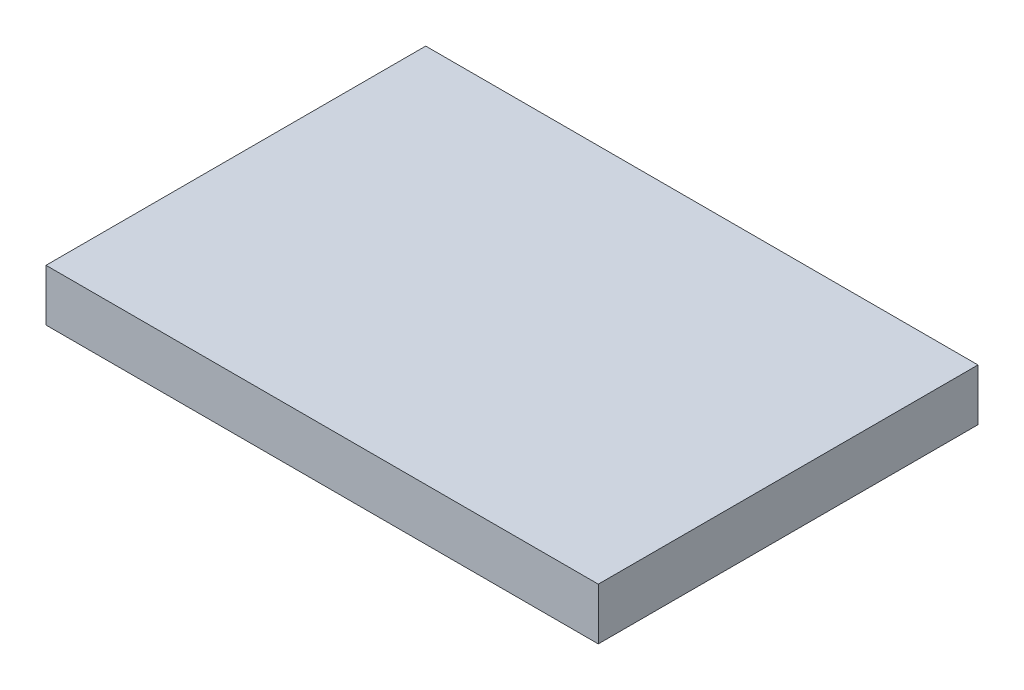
ISO-10303-21;
HEADER;
FILE_DESCRIPTION(('STEP AP214'),'2;1');
FILE_NAME('part.step','',(''),(''),'','','');
FILE_SCHEMA(('AUTOMOTIVE_DESIGN { 1 0 10303 214 1 1 1 1 }'));
ENDSEC;
DATA;
#1=APPLICATION_CONTEXT('core data for automotive mechanical design processes');
#2=APPLICATION_PROTOCOL_DEFINITION('international standard','automotive_design',2000,#1);
#3=PRODUCT_CONTEXT('',#1,'mechanical');
#4=PRODUCT('Part','Part','',(#3));
#5=PRODUCT_RELATED_PRODUCT_CATEGORY('part','',(#4));
#6=PRODUCT_DEFINITION_FORMATION('','',#4);
#7=PRODUCT_DEFINITION_CONTEXT('part definition',#1,'design');
#8=PRODUCT_DEFINITION('design','',#6,#7);
#9=PRODUCT_DEFINITION_SHAPE('','',#8);
#10=(LENGTH_UNIT() NAMED_UNIT(*) SI_UNIT(.MILLI.,.METRE.));
#11=(NAMED_UNIT(*) PLANE_ANGLE_UNIT() SI_UNIT($,.RADIAN.));
#12=(NAMED_UNIT(*) SI_UNIT($,.STERADIAN.) SOLID_ANGLE_UNIT());
#13=UNCERTAINTY_MEASURE_WITH_UNIT(LENGTH_MEASURE(1.E-05),#10,'distance_accuracy_value','');
#14=(GEOMETRIC_REPRESENTATION_CONTEXT(3) GLOBAL_UNCERTAINTY_ASSIGNED_CONTEXT((#13)) GLOBAL_UNIT_ASSIGNED_CONTEXT((#10,
#11,#12)) REPRESENTATION_CONTEXT('',''));
#15=CARTESIAN_POINT('',(0.,0.,0.));
#16=DIRECTION('',(0.,0.,1.));
#17=DIRECTION('',(1.,0.,0.));
#18=AXIS2_PLACEMENT_3D('',#15,#16,#17);
#19=CARTESIAN_POINT('',(0.,0.,139.7));
#20=DIRECTION('',(1.,0.,0.));
#21=DIRECTION('',(0.,0.,-1.));
#22=AXIS2_PLACEMENT_3D('',#19,#20,#21);
#23=PLANE('',#22);
#24=DIRECTION('',(0.,-1.,0.));
#25=VECTOR('',#24,1.);
#26=CARTESIAN_POINT('',(0.,0.,0.));
#27=LINE('',#26,#25);
#28=CARTESIAN_POINT('',(0.,19.05,0.));
#29=VERTEX_POINT('',#28);
#30=CARTESIAN_POINT('',(0.,0.,0.));
#31=VERTEX_POINT('',#30);
#32=EDGE_CURVE('E140',#29,#31,#27,.T.);
#33=ORIENTED_EDGE('',*,*,#32,.T.);
#34=DIRECTION('',(0.,0.,-1.));
#35=VECTOR('',#34,1.);
#36=CARTESIAN_POINT('',(0.,0.,139.7));
#37=LINE('',#36,#35);
#38=CARTESIAN_POINT('',(0.,0.,139.7));
#39=VERTEX_POINT('',#38);
#40=EDGE_CURVE('E11',#39,#31,#37,.T.);
#41=ORIENTED_EDGE('',*,*,#40,.F.);
#42=DIRECTION('',(0.,-1.,0.));
#43=VECTOR('',#42,1.);
#44=CARTESIAN_POINT('',(0.,0.,139.7));
#45=LINE('',#44,#43);
#46=CARTESIAN_POINT('',(0.,19.05,139.7));
#47=VERTEX_POINT('',#46);
#48=EDGE_CURVE('E144',#47,#39,#45,.T.);
#49=ORIENTED_EDGE('',*,*,#48,.F.);
#50=DIRECTION('',(0.,0.,-1.));
#51=VECTOR('',#50,1.);
#52=CARTESIAN_POINT('',(0.,19.05,139.7));
#53=LINE('',#52,#51);
#54=EDGE_CURVE('E150',#47,#29,#53,.T.);
#55=ORIENTED_EDGE('',*,*,#54,.T.);
#56=EDGE_LOOP('',(#33,#41,#49,#55));
#57=FACE_BOUND('',#56,.T.);
#58=ADVANCED_FACE('F32',(#57),#23,.F.);
#59=CARTESIAN_POINT('',(0.,0.,139.7));
#60=DIRECTION('',(0.,1.,0.));
#61=DIRECTION('',(0.,0.,1.));
#62=AXIS2_PLACEMENT_3D('',#59,#60,#61);
#63=PLANE('',#62);
#64=DIRECTION('',(1.,0.,0.));
#65=VECTOR('',#64,1.);
#66=CARTESIAN_POINT('',(88.9,0.,122.2375));
#67=LINE('',#66,#65);
#68=CARTESIAN_POINT('',(88.9,0.,122.2375));
#69=VERTEX_POINT('',#68);
#70=CARTESIAN_POINT('',(114.3,0.,122.2375));
#71=VERTEX_POINT('',#70);
#72=EDGE_CURVE('E134',#69,#71,#67,.T.);
#73=ORIENTED_EDGE('',*,*,#72,.F.);
#74=DIRECTION('',(0.,0.,-1.));
#75=VECTOR('',#74,1.);
#76=CARTESIAN_POINT('',(88.9,0.,122.2375));
#77=LINE('',#76,#75);
#78=CARTESIAN_POINT('',(88.9,0.,130.175));
#79=VERTEX_POINT('',#78);
#80=EDGE_CURVE('E46',#79,#69,#77,.T.);
#81=ORIENTED_EDGE('',*,*,#80,.F.);
#82=DIRECTION('',(-1.,0.,0.));
#83=VECTOR('',#82,1.);
#84=CARTESIAN_POINT('',(88.9,0.,130.175));
#85=LINE('',#84,#83);
#86=CARTESIAN_POINT('',(114.3,0.,130.175));
#87=VERTEX_POINT('',#86);
#88=EDGE_CURVE('E125',#87,#79,#85,.T.);
#89=ORIENTED_EDGE('',*,*,#88,.F.);
#90=DIRECTION('',(0.,0.,1.));
#91=VECTOR('',#90,1.);
#92=CARTESIAN_POINT('',(114.3,0.,122.2375));
#93=LINE('',#92,#91);
#94=EDGE_CURVE('E128',#71,#87,#93,.T.);
#95=ORIENTED_EDGE('',*,*,#94,.F.);
#96=EDGE_LOOP('',(#73,#81,#89,#95));
#97=FACE_BOUND('',#96,.T.);
#98=DIRECTION('',(1.,0.,0.));
#99=VECTOR('',#98,1.);
#100=CARTESIAN_POINT('',(0.,0.,0.));
#101=LINE('',#100,#99);
#102=CARTESIAN_POINT('',(203.2,0.,0.));
#103=VERTEX_POINT('',#102);
#104=EDGE_CURVE('E153',#31,#103,#101,.T.);
#105=ORIENTED_EDGE('',*,*,#104,.T.);
#106=DIRECTION('',(0.,0.,-1.));
#107=VECTOR('',#106,1.);
#108=CARTESIAN_POINT('',(203.2,0.,139.7));
#109=LINE('',#108,#107);
#110=CARTESIAN_POINT('',(203.2,0.,139.7));
#111=VERTEX_POINT('',#110);
#112=EDGE_CURVE('E39',#111,#103,#109,.T.);
#113=ORIENTED_EDGE('',*,*,#112,.F.);
#114=DIRECTION('',(1.,0.,0.));
#115=VECTOR('',#114,1.);
#116=CARTESIAN_POINT('',(0.,0.,139.7));
#117=LINE('',#116,#115);
#118=EDGE_CURVE('E83',#39,#111,#117,.T.);
#119=ORIENTED_EDGE('',*,*,#118,.F.);
#120=ORIENTED_EDGE('',*,*,#40,.T.);
#121=EDGE_LOOP('',(#105,#113,#119,#120));
#122=FACE_BOUND('',#121,.T.);
#123=ADVANCED_FACE('F181',(#97,#122),#63,.F.);
#124=CARTESIAN_POINT('',(203.2,0.,139.7));
#125=DIRECTION('',(-1.,0.,0.));
#126=DIRECTION('',(0.,0.,1.));
#127=AXIS2_PLACEMENT_3D('',#124,#125,#126);
#128=PLANE('',#127);
#129=DIRECTION('',(0.,1.,0.));
#130=VECTOR('',#129,1.);
#131=CARTESIAN_POINT('',(203.2,0.,0.));
#132=LINE('',#131,#130);
#133=CARTESIAN_POINT('',(203.2,19.05,0.));
#134=VERTEX_POINT('',#133);
#135=EDGE_CURVE('E155',#103,#134,#132,.T.);
#136=ORIENTED_EDGE('',*,*,#135,.T.);
#137=DIRECTION('',(0.,0.,-1.));
#138=VECTOR('',#137,1.);
#139=CARTESIAN_POINT('',(203.2,19.05,139.7));
#140=LINE('',#139,#138);
#141=CARTESIAN_POINT('',(203.2,19.05,139.7));
#142=VERTEX_POINT('',#141);
#143=EDGE_CURVE('E159',#142,#134,#140,.T.);
#144=ORIENTED_EDGE('',*,*,#143,.F.);
#145=DIRECTION('',(0.,1.,0.));
#146=VECTOR('',#145,1.);
#147=CARTESIAN_POINT('',(203.2,0.,139.7));
#148=LINE('',#147,#146);
#149=EDGE_CURVE('E147',#111,#142,#148,.T.);
#150=ORIENTED_EDGE('',*,*,#149,.F.);
#151=ORIENTED_EDGE('',*,*,#112,.T.);
#152=EDGE_LOOP('',(#136,#144,#150,#151));
#153=FACE_BOUND('',#152,.T.);
#154=ADVANCED_FACE('F164',(#153),#128,.F.);
#155=CARTESIAN_POINT('',(0.,19.05,139.7));
#156=DIRECTION('',(0.,-1.,0.));
#157=DIRECTION('',(0.,0.,-1.));
#158=AXIS2_PLACEMENT_3D('',#155,#156,#157);
#159=PLANE('',#158);
#160=DIRECTION('',(-1.,0.,0.));
#161=VECTOR('',#160,1.);
#162=CARTESIAN_POINT('',(0.,19.05,0.));
#163=LINE('',#162,#161);
#164=EDGE_CURVE('E76',#134,#29,#163,.T.);
#165=ORIENTED_EDGE('',*,*,#164,.T.);
#166=ORIENTED_EDGE('',*,*,#54,.F.);
#167=DIRECTION('',(-1.,0.,0.));
#168=VECTOR('',#167,1.);
#169=CARTESIAN_POINT('',(0.,19.05,139.7));
#170=LINE('',#169,#168);
#171=EDGE_CURVE('E55',#142,#47,#170,.T.);
#172=ORIENTED_EDGE('',*,*,#171,.F.);
#173=ORIENTED_EDGE('',*,*,#143,.T.);
#174=EDGE_LOOP('',(#165,#166,#172,#173));
#175=FACE_BOUND('',#174,.T.);
#176=ADVANCED_FACE('F172',(#175),#159,.F.);
#177=CARTESIAN_POINT('',(0.,19.05,139.7));
#178=DIRECTION('',(0.,0.,-1.));
#179=DIRECTION('',(-1.,0.,0.));
#180=AXIS2_PLACEMENT_3D('',#177,#178,#179);
#181=PLANE('',#180);
#182=ORIENTED_EDGE('',*,*,#48,.T.);
#183=ORIENTED_EDGE('',*,*,#118,.T.);
#184=ORIENTED_EDGE('',*,*,#149,.T.);
#185=ORIENTED_EDGE('',*,*,#171,.T.);
#186=EDGE_LOOP('',(#182,#183,#184,#185));
#187=FACE_BOUND('',#186,.T.);
#188=ADVANCED_FACE('F174',(#187),#181,.F.);
#189=CARTESIAN_POINT('',(0.,19.05,0.));
#190=DIRECTION('',(0.,0.,-1.));
#191=DIRECTION('',(-1.,0.,0.));
#192=AXIS2_PLACEMENT_3D('',#189,#190,#191);
#193=PLANE('',#192);
#194=ORIENTED_EDGE('',*,*,#32,.F.);
#195=ORIENTED_EDGE('',*,*,#164,.F.);
#196=ORIENTED_EDGE('',*,*,#135,.F.);
#197=ORIENTED_EDGE('',*,*,#104,.F.);
#198=EDGE_LOOP('',(#194,#195,#196,#197));
#199=FACE_BOUND('',#198,.T.);
#200=ADVANCED_FACE('F168',(#199),#193,.T.);
#201=CARTESIAN_POINT('',(88.9,0.793749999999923,122.2375));
#202=DIRECTION('',(-1.,0.,0.));
#203=DIRECTION('',(0.,0.,1.));
#204=AXIS2_PLACEMENT_3D('',#201,#202,#203);
#205=PLANE('',#204);
#206=ORIENTED_EDGE('',*,*,#80,.T.);
#207=DIRECTION('',(0.,-1.,0.));
#208=VECTOR('',#207,1.);
#209=CARTESIAN_POINT('',(88.9,0.793749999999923,122.2375));
#210=LINE('',#209,#208);
#211=CARTESIAN_POINT('',(88.9,0.793749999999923,122.2375));
#212=VERTEX_POINT('',#211);
#213=EDGE_CURVE('E103',#212,#69,#210,.T.);
#214=ORIENTED_EDGE('',*,*,#213,.F.);
#215=DIRECTION('',(0.,0.,-1.));
#216=VECTOR('',#215,1.);
#217=CARTESIAN_POINT('',(88.9,0.793749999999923,122.2375));
#218=LINE('',#217,#216);
#219=CARTESIAN_POINT('',(88.9,0.793749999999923,130.175));
#220=VERTEX_POINT('',#219);
#221=EDGE_CURVE('E107',#220,#212,#218,.T.);
#222=ORIENTED_EDGE('',*,*,#221,.F.);
#223=DIRECTION('',(0.,-1.,0.));
#224=VECTOR('',#223,1.);
#225=CARTESIAN_POINT('',(88.9,0.793749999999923,130.175));
#226=LINE('',#225,#224);
#227=EDGE_CURVE('E138',#220,#79,#226,.T.);
#228=ORIENTED_EDGE('',*,*,#227,.T.);
#229=EDGE_LOOP('',(#206,#214,#222,#228));
#230=FACE_BOUND('',#229,.T.);
#231=ADVANCED_FACE('F105',(#230),#205,.F.);
#232=CARTESIAN_POINT('',(88.9,0.793749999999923,130.175));
#233=DIRECTION('',(0.,0.,1.));
#234=DIRECTION('',(1.,0.,0.));
#235=AXIS2_PLACEMENT_3D('',#232,#233,#234);
#236=PLANE('',#235);
#237=ORIENTED_EDGE('',*,*,#88,.T.);
#238=ORIENTED_EDGE('',*,*,#227,.F.);
#239=DIRECTION('',(-1.,0.,0.));
#240=VECTOR('',#239,1.);
#241=CARTESIAN_POINT('',(88.9,0.793749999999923,130.175));
#242=LINE('',#241,#240);
#243=CARTESIAN_POINT('',(114.3,0.793749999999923,130.175));
#244=VERTEX_POINT('',#243);
#245=EDGE_CURVE('E113',#244,#220,#242,.T.);
#246=ORIENTED_EDGE('',*,*,#245,.F.);
#247=DIRECTION('',(0.,-1.,0.));
#248=VECTOR('',#247,1.);
#249=CARTESIAN_POINT('',(114.3,0.793749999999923,130.175));
#250=LINE('',#249,#248);
#251=EDGE_CURVE('E141',#244,#87,#250,.T.);
#252=ORIENTED_EDGE('',*,*,#251,.T.);
#253=EDGE_LOOP('',(#237,#238,#246,#252));
#254=FACE_BOUND('',#253,.T.);
#255=ADVANCED_FACE('F196',(#254),#236,.F.);
#256=CARTESIAN_POINT('',(114.3,0.793749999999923,122.2375));
#257=DIRECTION('',(1.,0.,0.));
#258=DIRECTION('',(0.,0.,-1.));
#259=AXIS2_PLACEMENT_3D('',#256,#257,#258);
#260=PLANE('',#259);
#261=ORIENTED_EDGE('',*,*,#94,.T.);
#262=ORIENTED_EDGE('',*,*,#251,.F.);
#263=DIRECTION('',(0.,0.,1.));
#264=VECTOR('',#263,1.);
#265=CARTESIAN_POINT('',(114.3,0.793749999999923,122.2375));
#266=LINE('',#265,#264);
#267=CARTESIAN_POINT('',(114.3,0.793749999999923,122.2375));
#268=VERTEX_POINT('',#267);
#269=EDGE_CURVE('E121',#268,#244,#266,.T.);
#270=ORIENTED_EDGE('',*,*,#269,.F.);
#271=DIRECTION('',(0.,-1.,0.));
#272=VECTOR('',#271,1.);
#273=CARTESIAN_POINT('',(114.3,0.793749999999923,122.2375));
#274=LINE('',#273,#272);
#275=EDGE_CURVE('E112',#268,#71,#274,.T.);
#276=ORIENTED_EDGE('',*,*,#275,.T.);
#277=EDGE_LOOP('',(#261,#262,#270,#276));
#278=FACE_BOUND('',#277,.T.);
#279=ADVANCED_FACE('F194',(#278),#260,.F.);
#280=CARTESIAN_POINT('',(88.9,0.793749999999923,122.2375));
#281=DIRECTION('',(0.,0.,-1.));
#282=DIRECTION('',(-1.,0.,0.));
#283=AXIS2_PLACEMENT_3D('',#280,#281,#282);
#284=PLANE('',#283);
#285=ORIENTED_EDGE('',*,*,#72,.T.);
#286=ORIENTED_EDGE('',*,*,#275,.F.);
#287=DIRECTION('',(1.,0.,0.));
#288=VECTOR('',#287,1.);
#289=CARTESIAN_POINT('',(88.9,0.793749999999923,122.2375));
#290=LINE('',#289,#288);
#291=EDGE_CURVE('E116',#212,#268,#290,.T.);
#292=ORIENTED_EDGE('',*,*,#291,.F.);
#293=ORIENTED_EDGE('',*,*,#213,.T.);
#294=EDGE_LOOP('',(#285,#286,#292,#293));
#295=FACE_BOUND('',#294,.T.);
#296=ADVANCED_FACE('F117',(#295),#284,.F.);
#297=CARTESIAN_POINT('',(88.9,0.793749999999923,130.175));
#298=DIRECTION('',(0.,1.,0.));
#299=DIRECTION('',(0.,0.,1.));
#300=AXIS2_PLACEMENT_3D('',#297,#298,#299);
#301=PLANE('',#300);
#302=ORIENTED_EDGE('',*,*,#221,.T.);
#303=ORIENTED_EDGE('',*,*,#291,.T.);
#304=ORIENTED_EDGE('',*,*,#269,.T.);
#305=ORIENTED_EDGE('',*,*,#245,.T.);
#306=EDGE_LOOP('',(#302,#303,#304,#305));
#307=FACE_BOUND('',#306,.T.);
#308=ADVANCED_FACE('F123',(#307),#301,.F.);
#309=CLOSED_SHELL('',(#58,#123,#154,#176,#188,#200,#231,#255,#279,#296,#308));
#310=MANIFOLD_SOLID_BREP('B2',#309);
#311=ADVANCED_BREP_SHAPE_REPRESENTATION('',(#18,#310),#14);
#312=SHAPE_DEFINITION_REPRESENTATION(#9,#311);
ENDSEC;
END-ISO-10303-21;
